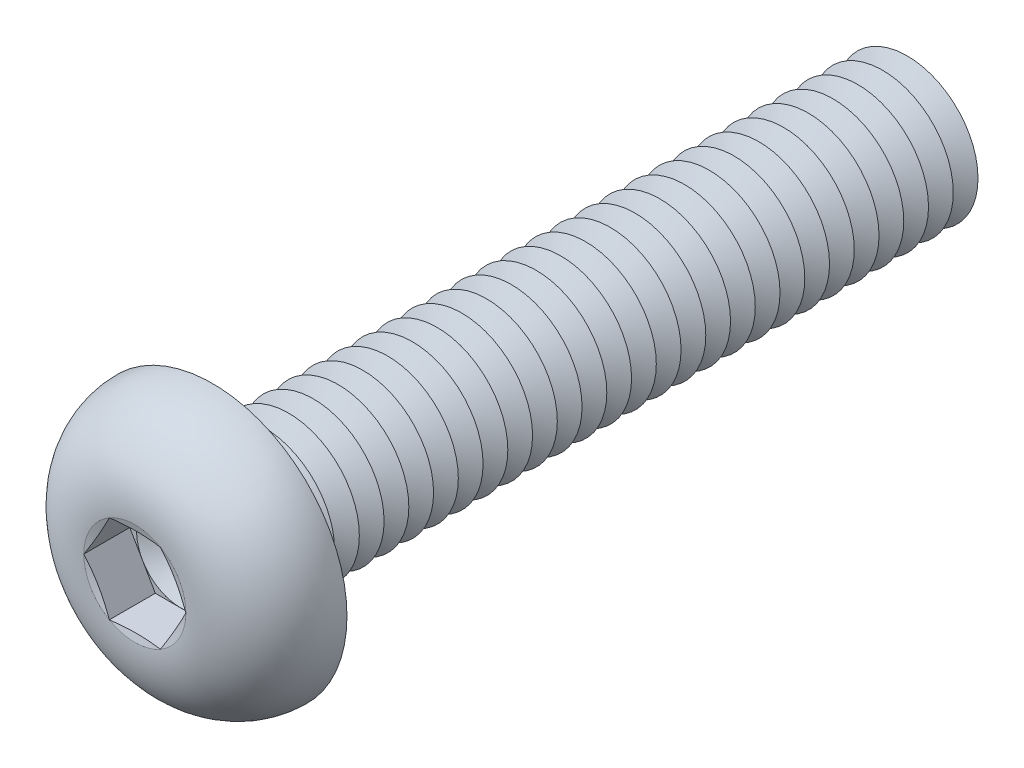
from build123d import *

# Parameters (mm, degrees)
FILLET1_R          = 0.35
LPATTERN1_COUNT    = 28
LPATTERN1_PITCH    = 0.7
CUT_EXTRUDE1_DEPTH = 1.3


with BuildPart() as part:
    # Sketch1 → Revolve1 (revolve)
    with BuildSketch(Plane(origin=(0, 0, 0), x_dir=(0, 0, -1), z_dir=(1, 0, 0)), mode=Mode.PRIVATE) as revolve1_sk:
        with BuildLine():
            Line((0, 2), (0, 3.8))
            ThreePointArc((0, 3.8), (-1.611961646, 3.099623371), (-2.2, 1.443375))
            Line((-2.2, 1.443375), (-2.006624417, 0.7216875))
            Line((-2.006624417, 0.7216875), (-2.2, 0.7216875))
            Line((-2.2, 0.7216875), (-2.2, 0))
            Line((-2.2, 0), (20, 0))
            Line((20, 0), (20, 2))
            Line((20, 2), (0, 2))
        make_face()
    revolve(revolve1_sk.sketch.rotate(Axis((0, 0, -20), (0, 0, 1)), 90), axis=Axis((0, 0, -20), (0, 0, 1)))

    # Fillet1
    fillet1_edges = [part.edges().sort_by_distance(p)[0] for p in [
        (2, 0, 0),
    ]]
    fillet(fillet1_edges, radius=FILLET1_R)

    # Sketch2 → Cut-Revolve1 (revolve, cut)
    with BuildSketch(Plane(origin=(0, 0, 0), x_dir=(0, 0, -1), z_dir=(1, 0, 0)), mode=Mode.PRIVATE) as cut_revolve1_sk:
        Polygon((19.65, 2), (20.35, 2), (20, 1.393782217), align=None)
    cut_revolve1 = revolve(cut_revolve1_sk.sketch.rotate(Axis((0, 0, -20), (0, 0, -1)), 270), axis=Axis((0, 0, -20), (0, 0, -1)), mode=Mode.SUBTRACT)

    # LPattern1: Cut-Revolve1 ×28
    with Locations(*[(0, 0, i * LPATTERN1_PITCH) for i in range(1, LPATTERN1_COUNT)]):
        add(cut_revolve1, mode=Mode.SUBTRACT)

    # Sketch3 → Cut-Extrude1 (cut)
    with BuildSketch(Plane.XY.offset(2.2)):
        Polygon((0.7216875, 1.249999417), (-0.7216875, 1.249999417), (-1.443375, 0), (-0.7216875, -1.249999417), (0.7216875, -1.249999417), (1.443375, 0), align=None)
    extrude(amount=-CUT_EXTRUDE1_DEPTH, mode=Mode.SUBTRACT)

    # Cut-Extrude2 cone 1 section (on through the dimple's axis) → Cut-Extrude2 (revolve, cut)
    with BuildSketch(Plane(origin=(0, 0, 0.9), x_dir=(0, -1, 0), z_dir=(1, 0, 0))):
        Polygon((0, 0), (1.249999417, 0), (0, 0.7216875), align=None)
    revolve(axis=Axis((0, 0, 0.9), (0, 0, -1)), mode=Mode.SUBTRACT)


solid = part.part
